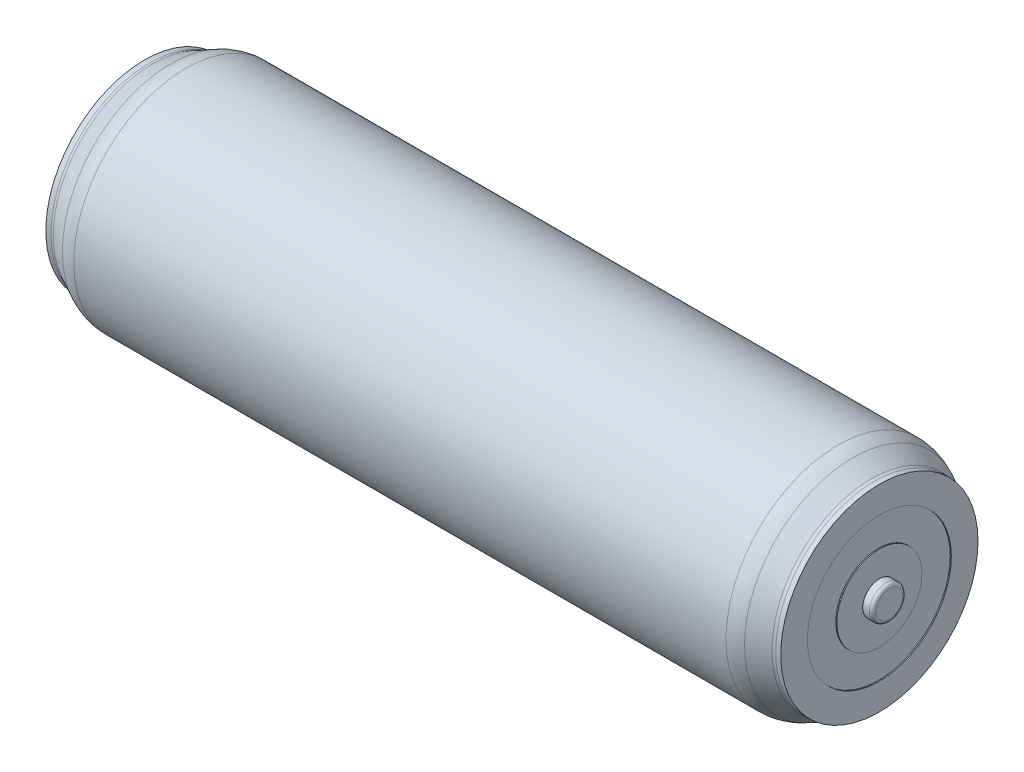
from build123d import *


with BuildPart() as part:
    # Esquisse1 → R_volution1 (revolve)
    with BuildSketch(Plane.XY, mode=Mode.PRIVATE) as r_volution1_sk:
        with BuildLine():
            Line((0, 14.75), (0.763932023, 14.75))
            ThreePointArc((0.763932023, 14.75), (0.993684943, 14.776751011), (1.211145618, 14.855572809))
            Line((1.211145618, 14.855572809), (3.94427191, 16.222135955))
            ThreePointArc((3.94427191, 16.222135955), (5.031575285, 16.616244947), (6.180339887, 16.75))
            Line((6.180339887, 16.75), (103.719660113, 16.75))
            ThreePointArc((103.719660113, 16.75), (104.868424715, 16.616244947), (105.95572809, 16.222135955))
            Line((105.95572809, 16.222135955), (108.688854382, 14.855572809))
            ThreePointArc((108.688854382, 14.855572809), (108.906315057, 14.776751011), (109.136067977, 14.75))
            Line((109.136067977, 14.75), (109.9, 14.75))
            Line((109.9, 14.75), (109.9, 10.760927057))
            Line((109.9, 10.760927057), (109.746341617, 10.760927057))
            Line((109.746341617, 10.760927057), (109.746341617, 6.35759511))
            Line((109.746341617, 6.35759511), (109.9, 6.35759511))
            Line((109.9, 6.35759511), (109.9, 2.5))
            Line((109.9, 2.5), (110.9, 2.5))
            ThreePointArc((110.9, 2.5), (111.253553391, 2.353553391), (111.4, 2))
            Line((111.4, 2), (111.4, 0))
            Line((111.4, 0), (0, 0))
            Line((0, 0), (0, 2.5))
            Line((0, 2.5), (0.144359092, 2.5))
            Line((0.144359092, 2.5), (0.144359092, 4.451654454))
            Line((0.144359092, 4.451654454), (0, 4.451654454))
            Line((0, 4.451654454), (0, 6.35759511))
            Line((0, 6.35759511), (0.144359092, 6.35759511))
            Line((0.144359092, 6.35759511), (0.144359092, 10.760927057))
            Line((0.144359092, 10.760927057), (0, 10.760927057))
            Line((0, 10.760927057), (0, 14.75))
        make_face()
    revolve(r_volution1_sk.sketch.rotate(Axis((124.515909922, 0, 0), (-1, 0, 0)), 90), axis=Axis((124.515909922, 0, 0), (-1, 0, 0)))


solid = part.part
